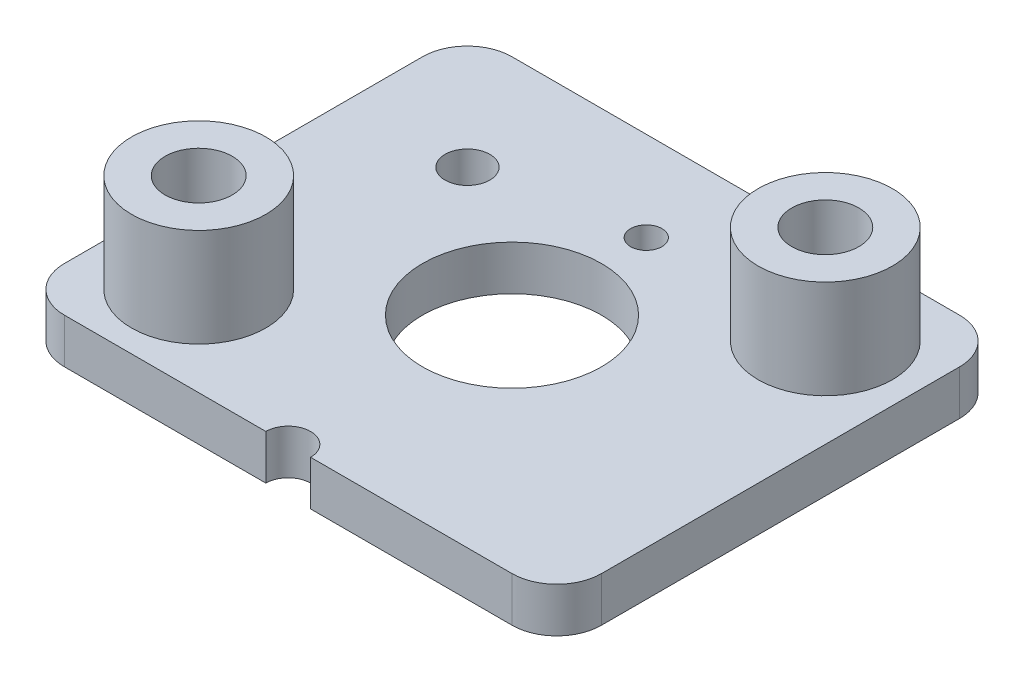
from build123d import *

# Parameters (mm, degrees)
CROQUIS1_R                = 1.5
CROQUIS1_R_2              = 2
CROQUIS1_R_3              = 0.35
CROQUIS1_R_4              = 0.5
SALIENTE_EXTRUIR1_DEPTH   = 1
CROQUIS2_R                = 1.5
SALIENTE_EXTRUIR2_DEPTH   = 2.2
SALIENTE_EXTRUIR2_2_DEPTH = 2.2
REDONDEO1_R               = 1
CROQUIS3_R                = 0.75
CORTAR_EXTRUIR1_DEPTH     = 2.2


with BuildPart() as part:
    # Croquis1 → Saliente-Extruir1 (new body)
    with BuildSketch(Plane(origin=(0, 0, 0), x_dir=(1, 0, 0), z_dir=(0, 1, 0))):
        with BuildLine():
            Line((-6, 5), (6, 5))
            Line((6, 5), (6, -5))
            Line((6, -5), (0.5, -5))
            ThreePointArc((0.5, -5), (0, -4.5), (-0.5, -5))
            Line((-0.5, -5), (-6, -5))
            Line((-6, -5), (-6, 5))
        make_face()
        with Locations(Location((4, 3, 0), (0, 0, 270))):
            Circle(CROQUIS1_R, mode=Mode.SUBTRACT)
        with Locations(Location((-4, -3, 0), (0, 0, 270))):
            Circle(CROQUIS1_R, mode=Mode.SUBTRACT)
        with Locations(Location((0, 0, 0), (0, 0, 270))):
            Circle(CROQUIS1_R_2, mode=Mode.SUBTRACT)
        with Locations(Location((0, 3, 0), (0, 0, 270))):
            Circle(CROQUIS1_R_3, mode=Mode.SUBTRACT)
        with Locations(Location((-3.360597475, 2.364908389, 0), (0, 0, 270))):
            Circle(CROQUIS1_R_4, mode=Mode.SUBTRACT)
    extrude(amount=SALIENTE_EXTRUIR1_DEPTH)

    # Redondeo1
    redondeo1_edges = [part.edges().sort_by_distance(p)[0] for p in [
        (-6, 0.5, 5),
        (-6, 0.5, -5),
        (6, 0.5, -5),
        (6, 0.5, 5),
    ]]
    fillet(redondeo1_edges, radius=REDONDEO1_R)


with BuildPart() as body_2:
    # Croquis2 → Saliente-Extruir2 (new body)
    with BuildSketch(Plane(origin=(0, 1, 0), x_dir=(1, 0, 0), z_dir=(0, 1, 0))):
        with Locations(Location((4, 3, 0), (0, 0, 270))):
            Circle(CROQUIS2_R)
    extrude(amount=SALIENTE_EXTRUIR2_DEPTH)


with BuildPart() as body_3:
    # Croquis2 → Saliente-Extruir2 2 (new body)
    with BuildSketch(Plane(origin=(0, 1, 0), x_dir=(1, 0, 0), z_dir=(0, 1, 0))):
        with Locations(Location((-4, -3, 0), (0, 0, 270))):
            Circle(CROQUIS2_R)
    extrude(amount=SALIENTE_EXTRUIR2_2_DEPTH)


with BuildPart() as cortar_extruir1_tool:
    # Croquis3 → Cortar-Extruir1 (new body)
    with BuildSketch(Plane(origin=(0, 3.2, 0), x_dir=(1, 0, 0), z_dir=(0, 1, 0))):
        with Locations(Location((4, 3, 0), (0, 0, 270))):
            Circle(CROQUIS3_R)
        with Locations(Location((-4, -3, 0), (0, 0, 270))):
            Circle(CROQUIS3_R)
    extrude(amount=-CORTAR_EXTRUIR1_DEPTH)


with BuildPart() as body_2_1:
    add(body_2.part)

    # Cortar-Extruir1: cut by cortar_extruir1_tool
    add(cortar_extruir1_tool.part, mode=Mode.SUBTRACT)


with BuildPart() as body_3_1:
    add(body_3.part)

    # Cortar-Extruir1: cut by cortar_extruir1_tool
    add(cortar_extruir1_tool.part, mode=Mode.SUBTRACT)


solid = Compound([part.part, body_2_1.part, body_3_1.part])
